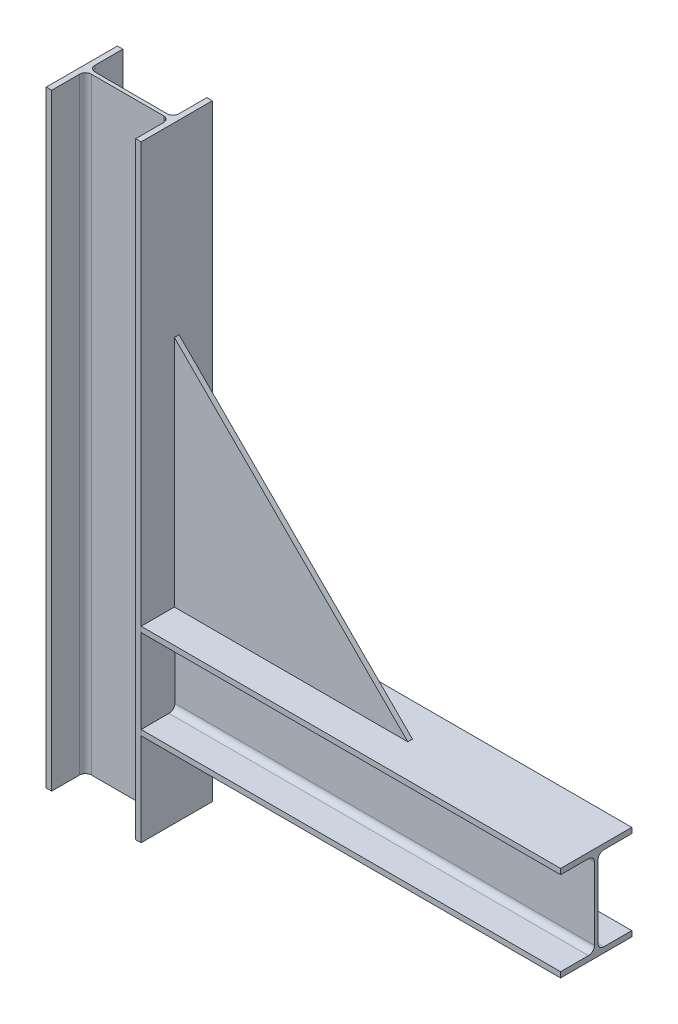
from build123d import *

# Parameters (mm, degrees)
AL_I_BEAM_AL_I_BEAM_4X2_31_1_DEPTH   = 650
AL_I_BEAM_AL_I_BEAM_4X2_31_1_2_DEPTH = 501
GUSSET1_THICKNESS                    = 5


with BuildPart() as part:
    # Sketch12 → Al i beam AL I BEAM 4X2.31_1 (new body)
    with BuildSketch(Plane(origin=(0, 500, 0), x_dir=(0, 0, 1), z_dir=(0, -1, 0))):
        with BuildLine():
            Line((-38.1, -50.8), (-38.1, -44.958))
            Line((-38.1, -44.958), (-8.255, -44.958))
            ThreePointArc((-8.255, -44.958), (-3.764871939, -43.098128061), (-1.905, -38.608))
            Line((-1.905, -38.608), (-1.905, 38.608))
            ThreePointArc((-1.905, 38.608), (-3.764871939, 43.098128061), (-8.255, 44.958))
            Line((-8.255, 44.958), (-38.1, 44.958))
            Line((-38.1, 44.958), (-38.1, 50.8))
            Line((-38.1, 50.8), (38.1, 50.8))
            Line((38.1, 50.8), (38.1, 44.958))
            Line((38.1, 44.958), (8.255, 44.958))
            ThreePointArc((8.255, 44.958), (3.764871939, 43.098128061), (1.905, 38.608))
            Line((1.905, 38.608), (1.905, -38.608))
            ThreePointArc((1.905, -38.608), (3.764871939, -43.098128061), (8.255, -44.958))
            Line((8.255, -44.958), (38.1, -44.958))
            Line((38.1, -44.958), (38.1, -50.8))
            Line((38.1, -50.8), (-38.1, -50.8))
        make_face()
    extrude(amount=AL_I_BEAM_AL_I_BEAM_4X2_31_1_DEPTH)


with BuildPart() as body_2:
    # Sketch12 on segment 2 (on carried to segment 2) → Al i beam AL I BEAM 4X2.31_1 2 (new body)
    with BuildSketch(Plane(origin=(-1, 0, 0), x_dir=(0, 0, 1), z_dir=(1, 0, 0))):
        with BuildLine():
            Line((-38.1, -50.8), (-38.1, -44.958))
            Line((-38.1, -44.958), (-8.255, -44.958))
            ThreePointArc((-8.255, -44.958), (-3.764871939, -43.098128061), (-1.905, -38.608))
            Line((-1.905, -38.608), (-1.905, 38.608))
            ThreePointArc((-1.905, 38.608), (-3.764871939, 43.098128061), (-8.255, 44.958))
            Line((-8.255, 44.958), (-38.1, 44.958))
            Line((-38.1, 44.958), (-38.1, 50.8))
            Line((-38.1, 50.8), (38.1, 50.8))
            Line((38.1, 50.8), (38.1, 44.958))
            Line((38.1, 44.958), (8.255, 44.958))
            ThreePointArc((8.255, 44.958), (3.764871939, 43.098128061), (1.905, 38.608))
            Line((1.905, 38.608), (1.905, -38.608))
            ThreePointArc((1.905, -38.608), (3.764871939, -43.098128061), (8.255, -44.958))
            Line((8.255, -44.958), (38.1, -44.958))
            Line((38.1, -44.958), (38.1, -50.8))
            Line((38.1, -50.8), (-38.1, -50.8))
        make_face()
    extrude(amount=AL_I_BEAM_AL_I_BEAM_4X2_31_1_2_DEPTH)

    # Al i beam AL I BEAM 4X2.31_1 2 end butt
    split(bisect_by=Plane.YZ.offset(50.8), keep=Keep.TOP)


with BuildPart() as body_3:
    # Gusset1: a gusset: a plate 5.0 thick in the corner of two members, its outline drawn in place
    gusset1_outline = Wire([Line((50.8, 50.8, -2.5), (50.8, 300.8, -2.5)), Line((50.8, 300.8, -2.5), (300.8, 50.8, -2.5)), Line((300.8, 50.8, -2.5), (50.8, 50.8, -2.5))])
    add(extrude(Face(gusset1_outline), amount=GUSSET1_THICKNESS, dir=(0, 0, 1)))


solid = Compound([part.part, body_2.part, body_3.part])
